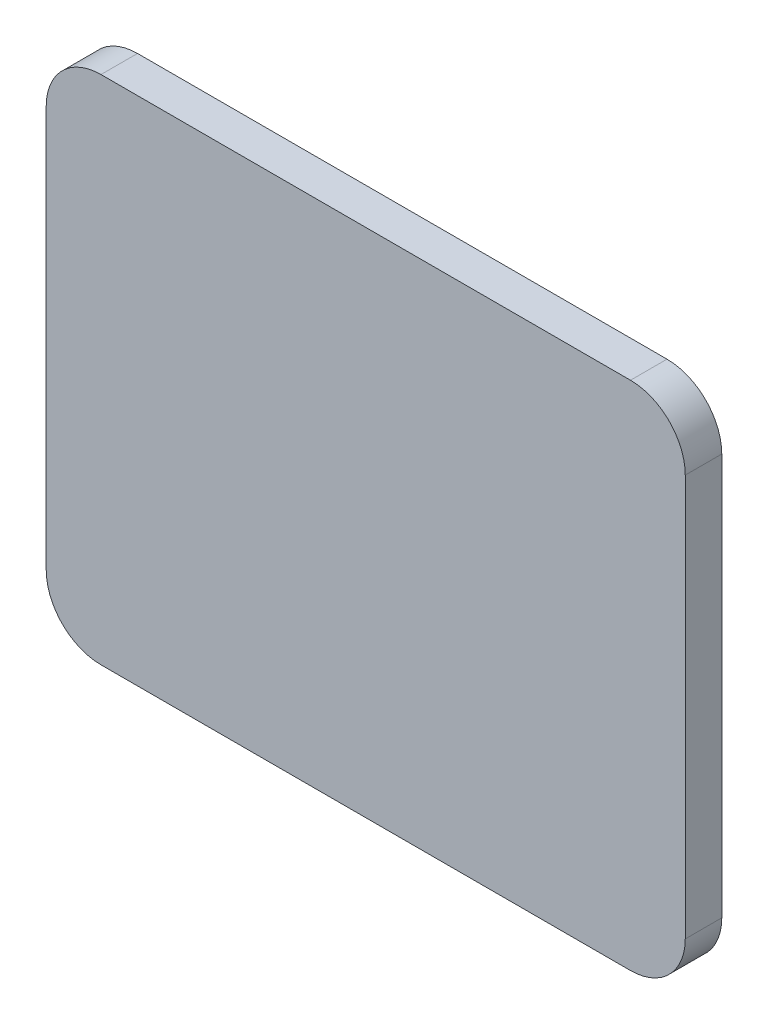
ISO-10303-21;
HEADER;
FILE_DESCRIPTION(('STEP AP214'),'2;1');
FILE_NAME('part.step','',(''),(''),'','','');
FILE_SCHEMA(('AUTOMOTIVE_DESIGN { 1 0 10303 214 1 1 1 1 }'));
ENDSEC;
DATA;
#1=APPLICATION_CONTEXT('core data for automotive mechanical design processes');
#2=APPLICATION_PROTOCOL_DEFINITION('international standard','automotive_design',2000,#1);
#3=PRODUCT_CONTEXT('',#1,'mechanical');
#4=PRODUCT('Part','Part','',(#3));
#5=PRODUCT_RELATED_PRODUCT_CATEGORY('part','',(#4));
#6=PRODUCT_DEFINITION_FORMATION('','',#4);
#7=PRODUCT_DEFINITION_CONTEXT('part definition',#1,'design');
#8=PRODUCT_DEFINITION('design','',#6,#7);
#9=PRODUCT_DEFINITION_SHAPE('','',#8);
#10=(LENGTH_UNIT() NAMED_UNIT(*) SI_UNIT(.MILLI.,.METRE.));
#11=(NAMED_UNIT(*) PLANE_ANGLE_UNIT() SI_UNIT($,.RADIAN.));
#12=(NAMED_UNIT(*) SI_UNIT($,.STERADIAN.) SOLID_ANGLE_UNIT());
#13=UNCERTAINTY_MEASURE_WITH_UNIT(LENGTH_MEASURE(1.E-05),#10,'distance_accuracy_value','');
#14=(GEOMETRIC_REPRESENTATION_CONTEXT(3) GLOBAL_UNCERTAINTY_ASSIGNED_CONTEXT((#13)) GLOBAL_UNIT_ASSIGNED_CONTEXT((#10,
#11,#12)) REPRESENTATION_CONTEXT('',''));
#15=CARTESIAN_POINT('',(0.,0.,0.));
#16=DIRECTION('',(0.,0.,1.));
#17=DIRECTION('',(1.,0.,0.));
#18=AXIS2_PLACEMENT_3D('',#15,#16,#17);
#19=CARTESIAN_POINT('',(-80.9184792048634,55.8795988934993,0.2));
#20=DIRECTION('',(0.,0.,-1.));
#21=DIRECTION('',(-1.,0.,0.));
#22=AXIS2_PLACEMENT_3D('',#19,#20,#21);
#23=CYLINDRICAL_SURFACE('',#22,0.299999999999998);
#24=CARTESIAN_POINT('',(-80.9184792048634,55.8795988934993,0.));
#25=DIRECTION('',(0.,0.,1.));
#26=DIRECTION('',(1.,0.,0.));
#27=AXIS2_PLACEMENT_3D('',#24,#25,#26);
#28=CIRCLE('',#27,0.299999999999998);
#29=CARTESIAN_POINT('',(-81.2184792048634,55.8795988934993,0.));
#30=VERTEX_POINT('',#29);
#31=CARTESIAN_POINT('',(-80.9184792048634,55.5795988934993,0.));
#32=VERTEX_POINT('',#31);
#33=EDGE_CURVE('E128',#30,#32,#28,.T.);
#34=ORIENTED_EDGE('',*,*,#33,.T.);
#35=DIRECTION('',(0.,0.,-1.));
#36=VECTOR('',#35,1.);
#37=CARTESIAN_POINT('',(-80.9184792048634,55.5795988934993,0.2));
#38=LINE('',#37,#36);
#39=CARTESIAN_POINT('',(-80.9184792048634,55.5795988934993,0.2));
#40=VERTEX_POINT('',#39);
#41=EDGE_CURVE('E11',#40,#32,#38,.T.);
#42=ORIENTED_EDGE('',*,*,#41,.F.);
#43=CARTESIAN_POINT('',(-80.9184792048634,55.8795988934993,0.2));
#44=DIRECTION('',(0.,0.,1.));
#45=DIRECTION('',(1.,0.,0.));
#46=AXIS2_PLACEMENT_3D('',#43,#44,#45);
#47=CIRCLE('',#46,0.299999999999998);
#48=CARTESIAN_POINT('',(-81.2184792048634,55.8795988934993,0.2));
#49=VERTEX_POINT('',#48);
#50=EDGE_CURVE('E142',#49,#40,#47,.T.);
#51=ORIENTED_EDGE('',*,*,#50,.F.);
#52=DIRECTION('',(0.,0.,-1.));
#53=VECTOR('',#52,1.);
#54=CARTESIAN_POINT('',(-81.2184792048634,55.8795988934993,0.2));
#55=LINE('',#54,#53);
#56=EDGE_CURVE('E124',#49,#30,#55,.T.);
#57=ORIENTED_EDGE('',*,*,#56,.T.);
#58=EDGE_LOOP('',(#34,#42,#51,#57));
#59=FACE_BOUND('',#58,.T.);
#60=ADVANCED_FACE('F32',(#59),#23,.T.);
#61=CARTESIAN_POINT('',(-80.9184792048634,55.5795988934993,0.2));
#62=DIRECTION('',(0.,1.,0.));
#63=DIRECTION('',(0.,0.,1.));
#64=AXIS2_PLACEMENT_3D('',#61,#62,#63);
#65=PLANE('',#64);
#66=DIRECTION('',(1.,0.,0.));
#67=VECTOR('',#66,1.);
#68=CARTESIAN_POINT('',(-80.9184792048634,55.5795988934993,0.));
#69=LINE('',#68,#67);
#70=CARTESIAN_POINT('',(-78.0184792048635,55.5795988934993,0.));
#71=VERTEX_POINT('',#70);
#72=EDGE_CURVE('E131',#32,#71,#69,.T.);
#73=ORIENTED_EDGE('',*,*,#72,.T.);
#74=DIRECTION('',(0.,0.,-1.));
#75=VECTOR('',#74,1.);
#76=CARTESIAN_POINT('',(-78.0184792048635,55.5795988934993,0.2));
#77=LINE('',#76,#75);
#78=CARTESIAN_POINT('',(-78.0184792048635,55.5795988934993,0.2));
#79=VERTEX_POINT('',#78);
#80=EDGE_CURVE('E40',#79,#71,#77,.T.);
#81=ORIENTED_EDGE('',*,*,#80,.F.);
#82=DIRECTION('',(1.,0.,0.));
#83=VECTOR('',#82,1.);
#84=CARTESIAN_POINT('',(-80.9184792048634,55.5795988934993,0.2));
#85=LINE('',#84,#83);
#86=EDGE_CURVE('E91',#40,#79,#85,.T.);
#87=ORIENTED_EDGE('',*,*,#86,.F.);
#88=ORIENTED_EDGE('',*,*,#41,.T.);
#89=EDGE_LOOP('',(#73,#81,#87,#88));
#90=FACE_BOUND('',#89,.T.);
#91=ADVANCED_FACE('F177',(#90),#65,.F.);
#92=CARTESIAN_POINT('',(-78.0184792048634,55.8795988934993,0.2));
#93=DIRECTION('',(0.,0.,-1.));
#94=DIRECTION('',(-1.,0.,0.));
#95=AXIS2_PLACEMENT_3D('',#92,#93,#94);
#96=CYLINDRICAL_SURFACE('',#95,0.299999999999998);
#97=CARTESIAN_POINT('',(-78.0184792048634,55.8795988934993,0.));
#98=DIRECTION('',(0.,0.,1.));
#99=DIRECTION('',(1.,0.,0.));
#100=AXIS2_PLACEMENT_3D('',#97,#98,#99);
#101=CIRCLE('',#100,0.299999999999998);
#102=CARTESIAN_POINT('',(-77.7184792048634,55.8795988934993,0.));
#103=VERTEX_POINT('',#102);
#104=EDGE_CURVE('E133',#71,#103,#101,.T.);
#105=ORIENTED_EDGE('',*,*,#104,.T.);
#106=DIRECTION('',(0.,0.,-1.));
#107=VECTOR('',#106,1.);
#108=CARTESIAN_POINT('',(-77.7184792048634,55.8795988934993,0.2));
#109=LINE('',#108,#107);
#110=CARTESIAN_POINT('',(-77.7184792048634,55.8795988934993,0.2));
#111=VERTEX_POINT('',#110);
#112=EDGE_CURVE('E149',#111,#103,#109,.T.);
#113=ORIENTED_EDGE('',*,*,#112,.F.);
#114=CARTESIAN_POINT('',(-78.0184792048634,55.8795988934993,0.2));
#115=DIRECTION('',(0.,0.,1.));
#116=DIRECTION('',(1.,0.,0.));
#117=AXIS2_PLACEMENT_3D('',#114,#115,#116);
#118=CIRCLE('',#117,0.299999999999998);
#119=EDGE_CURVE('E157',#79,#111,#118,.T.);
#120=ORIENTED_EDGE('',*,*,#119,.F.);
#121=ORIENTED_EDGE('',*,*,#80,.T.);
#122=EDGE_LOOP('',(#105,#113,#120,#121));
#123=FACE_BOUND('',#122,.T.);
#124=ADVANCED_FACE('F155',(#123),#96,.T.);
#125=CARTESIAN_POINT('',(-77.7184792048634,58.0795988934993,0.2));
#126=DIRECTION('',(-1.,0.,0.));
#127=DIRECTION('',(0.,0.,1.));
#128=AXIS2_PLACEMENT_3D('',#125,#126,#127);
#129=PLANE('',#128);
#130=DIRECTION('',(0.,1.,0.));
#131=VECTOR('',#130,1.);
#132=CARTESIAN_POINT('',(-77.7184792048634,58.0795988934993,0.));
#133=LINE('',#132,#131);
#134=CARTESIAN_POINT('',(-77.7184792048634,58.0795988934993,0.));
#135=VERTEX_POINT('',#134);
#136=EDGE_CURVE('E135',#103,#135,#133,.T.);
#137=ORIENTED_EDGE('',*,*,#136,.T.);
#138=DIRECTION('',(0.,0.,-1.));
#139=VECTOR('',#138,1.);
#140=CARTESIAN_POINT('',(-77.7184792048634,58.0795988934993,0.2));
#141=LINE('',#140,#139);
#142=CARTESIAN_POINT('',(-77.7184792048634,58.0795988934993,0.2));
#143=VERTEX_POINT('',#142);
#144=EDGE_CURVE('E146',#143,#135,#141,.T.);
#145=ORIENTED_EDGE('',*,*,#144,.F.);
#146=DIRECTION('',(0.,1.,0.));
#147=VECTOR('',#146,1.);
#148=CARTESIAN_POINT('',(-77.7184792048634,58.0795988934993,0.2));
#149=LINE('',#148,#147);
#150=EDGE_CURVE('E169',#111,#143,#149,.T.);
#151=ORIENTED_EDGE('',*,*,#150,.F.);
#152=ORIENTED_EDGE('',*,*,#112,.T.);
#153=EDGE_LOOP('',(#137,#145,#151,#152));
#154=FACE_BOUND('',#153,.T.);
#155=ADVANCED_FACE('F165',(#154),#129,.F.);
#156=CARTESIAN_POINT('',(-78.0184792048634,58.0795988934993,0.2));
#157=DIRECTION('',(0.,0.,-1.));
#158=DIRECTION('',(-1.,0.,0.));
#159=AXIS2_PLACEMENT_3D('',#156,#157,#158);
#160=CYLINDRICAL_SURFACE('',#159,0.299999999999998);
#161=CARTESIAN_POINT('',(-78.0184792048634,58.0795988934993,0.));
#162=DIRECTION('',(0.,0.,1.));
#163=DIRECTION('',(1.,0.,0.));
#164=AXIS2_PLACEMENT_3D('',#161,#162,#163);
#165=CIRCLE('',#164,0.299999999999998);
#166=CARTESIAN_POINT('',(-78.0184792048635,58.3795988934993,0.));
#167=VERTEX_POINT('',#166);
#168=EDGE_CURVE('E137',#135,#167,#165,.T.);
#169=ORIENTED_EDGE('',*,*,#168,.T.);
#170=DIRECTION('',(0.,0.,-1.));
#171=VECTOR('',#170,1.);
#172=CARTESIAN_POINT('',(-78.0184792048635,58.3795988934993,0.2));
#173=LINE('',#172,#171);
#174=CARTESIAN_POINT('',(-78.0184792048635,58.3795988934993,0.2));
#175=VERTEX_POINT('',#174);
#176=EDGE_CURVE('E119',#175,#167,#173,.T.);
#177=ORIENTED_EDGE('',*,*,#176,.F.);
#178=CARTESIAN_POINT('',(-78.0184792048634,58.0795988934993,0.2));
#179=DIRECTION('',(0.,0.,1.));
#180=DIRECTION('',(1.,0.,0.));
#181=AXIS2_PLACEMENT_3D('',#178,#179,#180);
#182=CIRCLE('',#181,0.299999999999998);
#183=EDGE_CURVE('E110',#143,#175,#182,.T.);
#184=ORIENTED_EDGE('',*,*,#183,.F.);
#185=ORIENTED_EDGE('',*,*,#144,.T.);
#186=EDGE_LOOP('',(#169,#177,#184,#185));
#187=FACE_BOUND('',#186,.T.);
#188=ADVANCED_FACE('F168',(#187),#160,.T.);
#189=CARTESIAN_POINT('',(-80.9184792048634,58.3795988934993,0.2));
#190=DIRECTION('',(0.,-1.,0.));
#191=DIRECTION('',(0.,0.,-1.));
#192=AXIS2_PLACEMENT_3D('',#189,#190,#191);
#193=PLANE('',#192);
#194=DIRECTION('',(-1.,0.,0.));
#195=VECTOR('',#194,1.);
#196=CARTESIAN_POINT('',(-80.9184792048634,58.3795988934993,0.));
#197=LINE('',#196,#195);
#198=CARTESIAN_POINT('',(-80.9184792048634,58.3795988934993,0.));
#199=VERTEX_POINT('',#198);
#200=EDGE_CURVE('E118',#167,#199,#197,.T.);
#201=ORIENTED_EDGE('',*,*,#200,.T.);
#202=DIRECTION('',(0.,0.,-1.));
#203=VECTOR('',#202,1.);
#204=CARTESIAN_POINT('',(-80.9184792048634,58.3795988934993,0.2));
#205=LINE('',#204,#203);
#206=CARTESIAN_POINT('',(-80.9184792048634,58.3795988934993,0.2));
#207=VERTEX_POINT('',#206);
#208=EDGE_CURVE('E115',#207,#199,#205,.T.);
#209=ORIENTED_EDGE('',*,*,#208,.F.);
#210=DIRECTION('',(-1.,0.,0.));
#211=VECTOR('',#210,1.);
#212=CARTESIAN_POINT('',(-80.9184792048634,58.3795988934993,0.2));
#213=LINE('',#212,#211);
#214=EDGE_CURVE('E104',#175,#207,#213,.T.);
#215=ORIENTED_EDGE('',*,*,#214,.F.);
#216=ORIENTED_EDGE('',*,*,#176,.T.);
#217=EDGE_LOOP('',(#201,#209,#215,#216));
#218=FACE_BOUND('',#217,.T.);
#219=ADVANCED_FACE('F116',(#218),#193,.F.);
#220=CARTESIAN_POINT('',(-80.9184792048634,58.0795988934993,0.2));
#221=DIRECTION('',(0.,0.,-1.));
#222=DIRECTION('',(-1.,0.,0.));
#223=AXIS2_PLACEMENT_3D('',#220,#221,#222);
#224=CYLINDRICAL_SURFACE('',#223,0.299999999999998);
#225=CARTESIAN_POINT('',(-80.9184792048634,58.0795988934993,0.));
#226=DIRECTION('',(0.,0.,1.));
#227=DIRECTION('',(-1.,0.,0.));
#228=AXIS2_PLACEMENT_3D('',#225,#226,#227);
#229=CIRCLE('',#228,0.299999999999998);
#230=CARTESIAN_POINT('',(-81.2184792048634,58.0795988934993,0.));
#231=VERTEX_POINT('',#230);
#232=EDGE_CURVE('E77',#199,#231,#229,.T.);
#233=ORIENTED_EDGE('',*,*,#232,.T.);
#234=DIRECTION('',(0.,0.,-1.));
#235=VECTOR('',#234,1.);
#236=CARTESIAN_POINT('',(-81.2184792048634,58.0795988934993,0.2));
#237=LINE('',#236,#235);
#238=CARTESIAN_POINT('',(-81.2184792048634,58.0795988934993,0.2));
#239=VERTEX_POINT('',#238);
#240=EDGE_CURVE('E120',#239,#231,#237,.T.);
#241=ORIENTED_EDGE('',*,*,#240,.F.);
#242=CARTESIAN_POINT('',(-80.9184792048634,58.0795988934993,0.2));
#243=DIRECTION('',(0.,0.,1.));
#244=DIRECTION('',(-1.,0.,0.));
#245=AXIS2_PLACEMENT_3D('',#242,#243,#244);
#246=CIRCLE('',#245,0.299999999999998);
#247=EDGE_CURVE('E108',#207,#239,#246,.T.);
#248=ORIENTED_EDGE('',*,*,#247,.F.);
#249=ORIENTED_EDGE('',*,*,#208,.T.);
#250=EDGE_LOOP('',(#233,#241,#248,#249));
#251=FACE_BOUND('',#250,.T.);
#252=ADVANCED_FACE('F122',(#251),#224,.T.);
#253=CARTESIAN_POINT('',(-81.2184792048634,58.0795988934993,0.2));
#254=DIRECTION('',(1.,0.,0.));
#255=DIRECTION('',(0.,0.,-1.));
#256=AXIS2_PLACEMENT_3D('',#253,#254,#255);
#257=PLANE('',#256);
#258=DIRECTION('',(0.,-1.,0.));
#259=VECTOR('',#258,1.);
#260=CARTESIAN_POINT('',(-81.2184792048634,58.0795988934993,0.));
#261=LINE('',#260,#259);
#262=EDGE_CURVE('E83',#231,#30,#261,.T.);
#263=ORIENTED_EDGE('',*,*,#262,.T.);
#264=ORIENTED_EDGE('',*,*,#56,.F.);
#265=DIRECTION('',(0.,-1.,0.));
#266=VECTOR('',#265,1.);
#267=CARTESIAN_POINT('',(-81.2184792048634,58.0795988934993,0.2));
#268=LINE('',#267,#266);
#269=EDGE_CURVE('E48',#239,#49,#268,.T.);
#270=ORIENTED_EDGE('',*,*,#269,.F.);
#271=ORIENTED_EDGE('',*,*,#240,.T.);
#272=EDGE_LOOP('',(#263,#264,#270,#271));
#273=FACE_BOUND('',#272,.T.);
#274=ADVANCED_FACE('F193',(#273),#257,.F.);
#275=CARTESIAN_POINT('',(-80.9184792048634,55.8795988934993,0.2));
#276=DIRECTION('',(0.,0.,1.));
#277=DIRECTION('',(1.,0.,0.));
#278=AXIS2_PLACEMENT_3D('',#275,#276,#277);
#279=PLANE('',#278);
#280=ORIENTED_EDGE('',*,*,#50,.T.);
#281=ORIENTED_EDGE('',*,*,#86,.T.);
#282=ORIENTED_EDGE('',*,*,#119,.T.);
#283=ORIENTED_EDGE('',*,*,#150,.T.);
#284=ORIENTED_EDGE('',*,*,#183,.T.);
#285=ORIENTED_EDGE('',*,*,#214,.T.);
#286=ORIENTED_EDGE('',*,*,#247,.T.);
#287=ORIENTED_EDGE('',*,*,#269,.T.);
#288=EDGE_LOOP('',(#280,#281,#282,#283,#284,#285,#286,#287));
#289=FACE_BOUND('',#288,.T.);
#290=ADVANCED_FACE('F106',(#289),#279,.T.);
#291=CARTESIAN_POINT('',(-80.9184792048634,55.8795988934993,0.));
#292=DIRECTION('',(0.,0.,1.));
#293=DIRECTION('',(1.,0.,0.));
#294=AXIS2_PLACEMENT_3D('',#291,#292,#293);
#295=PLANE('',#294);
#296=ORIENTED_EDGE('',*,*,#33,.F.);
#297=ORIENTED_EDGE('',*,*,#262,.F.);
#298=ORIENTED_EDGE('',*,*,#232,.F.);
#299=ORIENTED_EDGE('',*,*,#200,.F.);
#300=ORIENTED_EDGE('',*,*,#168,.F.);
#301=ORIENTED_EDGE('',*,*,#136,.F.);
#302=ORIENTED_EDGE('',*,*,#104,.F.);
#303=ORIENTED_EDGE('',*,*,#72,.F.);
#304=EDGE_LOOP('',(#296,#297,#298,#299,#300,#301,#302,#303));
#305=FACE_BOUND('',#304,.T.);
#306=ADVANCED_FACE('F161',(#305),#295,.F.);
#307=CLOSED_SHELL('',(#60,#91,#124,#155,#188,#219,#252,#274,#290,#306));
#308=MANIFOLD_SOLID_BREP('B2',#307);
#309=ADVANCED_BREP_SHAPE_REPRESENTATION('',(#18,#308),#14);
#310=SHAPE_DEFINITION_REPRESENTATION(#9,#309);
ENDSEC;
END-ISO-10303-21;
